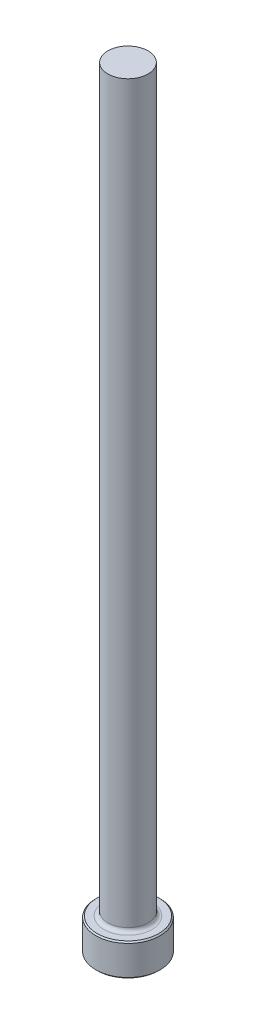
from build123d import *

# Parameters (mm, degrees)
CHAMFER1_SIZE = 0.254
FILLET1_R     = 0.762


with BuildPart() as part:
    # Sketch1 → Revolve1 (revolve)
    with BuildSketch(Plane.XY, mode=Mode.PRIVATE) as revolve1_sk:
        Polygon((0, 0), (-6.35, 0), (-6.35, 6.35), (-3.96875, 6.35), (-3.96875, 152.4), (0, 152.4), align=None)
    revolve(revolve1_sk.sketch.rotate(Axis((0, 259.958771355, 0), (0, -1, 0)), 270), axis=Axis((0, 259.958771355, 0), (0, -1, 0)))

    # Chamfer1
    chamfer1_edges = [part.edges().sort_by_distance(p)[0] for p in [
        (0, 6.35, -6.35),
        (0, 0, -6.35),
    ]]
    chamfer(chamfer1_edges, length=CHAMFER1_SIZE)

    # Fillet1
    fillet1_edges = [part.edges().sort_by_distance(p)[0] for p in [
        (0, 6.35, -3.96875),
    ]]
    fillet(fillet1_edges, radius=FILLET1_R)


solid = part.part
